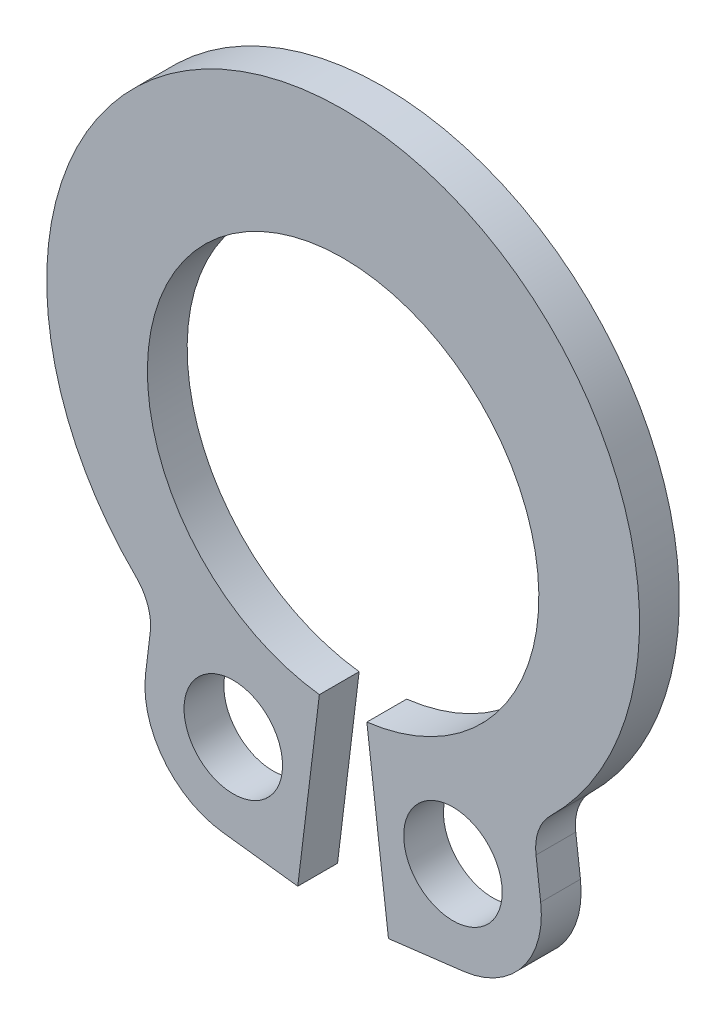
from build123d import *

# Parameters (mm, degrees)
BODY_DEPTH  = 0.8
HOLSKE_R    = 0.9906
HOLES_DEPTH = 10.585454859


with BuildPart() as part:
    # BodySke → Body (new body)
    with BuildSketch(Plane.XY):
        with BuildLine():
            Line((0.477599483, -3.907923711), (0.912060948, -7.462873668))
            Line((0.912060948, -7.462873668), (2.42480561, -7.277996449))
            ThreePointArc((2.42480561, -7.277996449), (3.609582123, -6.608562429), (3.973984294, -5.297437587))
            Line((3.973984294, -5.297437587), (3.879429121, -4.523746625))
            ThreePointArc((3.879429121, -4.523746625), (3.927936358, -4.07573393), (4.169886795, -3.695565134))
            ThreePointArc((4.169886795, -3.695565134), (0, 6.5278), (-4.169886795, -3.695565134))
            ThreePointArc((-4.169886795, -3.695565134), (-3.927936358, -4.07573393), (-3.879429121, -4.523746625))
            Line((-3.879429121, -4.523746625), (-3.973984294, -5.297437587))
            ThreePointArc((-3.973984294, -5.297437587), (-3.609582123, -6.608562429), (-2.42480561, -7.277996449))
            Line((-2.42480561, -7.277996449), (-0.912060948, -7.462873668))
            Line((-0.912060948, -7.462873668), (-0.477599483, -3.907923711))
            ThreePointArc((-0.477599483, -3.907923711), (0, 3.937), (0.477599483, -3.907923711))
        make_face()
    extrude(amount=-BODY_DEPTH)

    # HolSke → Holes (cut, through all)
    with BuildSketch(Plane.XY):
        with Locations((2.209115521, -5.513127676)):
            Circle(HOLSKE_R)
        with Locations((-2.209115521, -5.513127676)):
            Circle(HOLSKE_R)
    extrude(amount=-HOLES_DEPTH, mode=Mode.SUBTRACT)


solid = part.part
